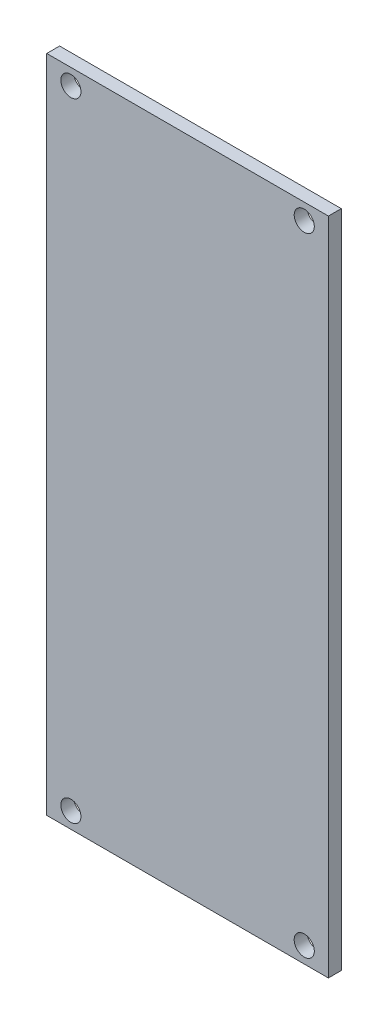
ISO-10303-21;
HEADER;
FILE_DESCRIPTION(('STEP AP214'),'2;1');
FILE_NAME('part.step','',(''),(''),'','','');
FILE_SCHEMA(('AUTOMOTIVE_DESIGN { 1 0 10303 214 1 1 1 1 }'));
ENDSEC;
DATA;
#1=APPLICATION_CONTEXT('core data for automotive mechanical design processes');
#2=APPLICATION_PROTOCOL_DEFINITION('international standard','automotive_design',2000,#1);
#3=PRODUCT_CONTEXT('',#1,'mechanical');
#4=PRODUCT('Part','Part','',(#3));
#5=PRODUCT_RELATED_PRODUCT_CATEGORY('part','',(#4));
#6=PRODUCT_DEFINITION_FORMATION('','',#4);
#7=PRODUCT_DEFINITION_CONTEXT('part definition',#1,'design');
#8=PRODUCT_DEFINITION('design','',#6,#7);
#9=PRODUCT_DEFINITION_SHAPE('','',#8);
#10=(LENGTH_UNIT() NAMED_UNIT(*) SI_UNIT(.MILLI.,.METRE.));
#11=(NAMED_UNIT(*) PLANE_ANGLE_UNIT() SI_UNIT($,.RADIAN.));
#12=(NAMED_UNIT(*) SI_UNIT($,.STERADIAN.) SOLID_ANGLE_UNIT());
#13=UNCERTAINTY_MEASURE_WITH_UNIT(LENGTH_MEASURE(1.E-05),#10,'distance_accuracy_value','');
#14=(GEOMETRIC_REPRESENTATION_CONTEXT(3) GLOBAL_UNCERTAINTY_ASSIGNED_CONTEXT((#13)) GLOBAL_UNIT_ASSIGNED_CONTEXT((#10,
#11,#12)) REPRESENTATION_CONTEXT('',''));
#15=CARTESIAN_POINT('',(0.,0.,0.));
#16=DIRECTION('',(0.,0.,1.));
#17=DIRECTION('',(1.,0.,0.));
#18=AXIS2_PLACEMENT_3D('',#15,#16,#17);
#19=CARTESIAN_POINT('',(0.,0.,-2.032));
#20=DIRECTION('',(-0.999999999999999,0.,0.));
#21=DIRECTION('',(0.,0.,1.));
#22=AXIS2_PLACEMENT_3D('',#19,#20,#21);
#23=PLANE('',#22);
#24=DIRECTION('',(0.,-1.,0.));
#25=VECTOR('',#24,1.);
#26=CARTESIAN_POINT('',(0.,0.,0.));
#27=LINE('',#26,#25);
#28=CARTESIAN_POINT('',(0.,104.14,0.));
#29=VERTEX_POINT('',#28);
#30=CARTESIAN_POINT('',(0.,0.,0.));
#31=VERTEX_POINT('',#30);
#32=EDGE_CURVE('E73',#29,#31,#27,.T.);
#33=ORIENTED_EDGE('',*,*,#32,.F.);
#34=DIRECTION('',(0.,0.,1.));
#35=VECTOR('',#34,1.);
#36=CARTESIAN_POINT('',(0.,104.14,-2.03200000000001));
#37=LINE('',#36,#35);
#38=CARTESIAN_POINT('',(0.,104.14,-2.03200000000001));
#39=VERTEX_POINT('',#38);
#40=EDGE_CURVE('E11',#39,#29,#37,.T.);
#41=ORIENTED_EDGE('',*,*,#40,.F.);
#42=DIRECTION('',(0.,-1.,0.));
#43=VECTOR('',#42,1.);
#44=CARTESIAN_POINT('',(0.,0.,-2.032));
#45=LINE('',#44,#43);
#46=CARTESIAN_POINT('',(0.,0.,-2.032));
#47=VERTEX_POINT('',#46);
#48=EDGE_CURVE('E75',#39,#47,#45,.T.);
#49=ORIENTED_EDGE('',*,*,#48,.T.);
#50=DIRECTION('',(0.,0.,1.));
#51=VECTOR('',#50,1.);
#52=CARTESIAN_POINT('',(0.,0.,-2.032));
#53=LINE('',#52,#51);
#54=EDGE_CURVE('E36',#47,#31,#53,.T.);
#55=ORIENTED_EDGE('',*,*,#54,.T.);
#56=EDGE_LOOP('',(#33,#41,#49,#55));
#57=FACE_BOUND('',#56,.T.);
#58=ADVANCED_FACE('F33',(#57),#23,.T.);
#59=CARTESIAN_POINT('',(0.,104.14,-2.03200000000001));
#60=DIRECTION('',(0.,1.,0.));
#61=DIRECTION('',(0.,0.,1.));
#62=AXIS2_PLACEMENT_3D('',#59,#60,#61);
#63=PLANE('',#62);
#64=DIRECTION('',(-0.999999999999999,0.,0.));
#65=VECTOR('',#64,1.);
#66=CARTESIAN_POINT('',(0.,104.14,0.));
#67=LINE('',#66,#65);
#68=CARTESIAN_POINT('',(44.45,104.14,0.));
#69=VERTEX_POINT('',#68);
#70=EDGE_CURVE('E90',#69,#29,#67,.T.);
#71=ORIENTED_EDGE('',*,*,#70,.F.);
#72=DIRECTION('',(0.,0.,1.));
#73=VECTOR('',#72,1.);
#74=CARTESIAN_POINT('',(44.45,104.14,-2.03200000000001));
#75=LINE('',#74,#73);
#76=CARTESIAN_POINT('',(44.45,104.14,-2.03200000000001));
#77=VERTEX_POINT('',#76);
#78=EDGE_CURVE('E41',#77,#69,#75,.T.);
#79=ORIENTED_EDGE('',*,*,#78,.F.);
#80=DIRECTION('',(-0.999999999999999,0.,0.));
#81=VECTOR('',#80,1.);
#82=CARTESIAN_POINT('',(0.,104.14,-2.03200000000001));
#83=LINE('',#82,#81);
#84=EDGE_CURVE('E80',#77,#39,#83,.T.);
#85=ORIENTED_EDGE('',*,*,#84,.T.);
#86=ORIENTED_EDGE('',*,*,#40,.T.);
#87=EDGE_LOOP('',(#71,#79,#85,#86));
#88=FACE_BOUND('',#87,.T.);
#89=ADVANCED_FACE('F110',(#88),#63,.T.);
#90=CARTESIAN_POINT('',(44.45,0.,-2.032));
#91=DIRECTION('',(0.999999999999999,0.,0.));
#92=DIRECTION('',(0.,0.,-1.));
#93=AXIS2_PLACEMENT_3D('',#90,#91,#92);
#94=PLANE('',#93);
#95=DIRECTION('',(0.,1.,0.));
#96=VECTOR('',#95,1.);
#97=CARTESIAN_POINT('',(44.45,0.,0.));
#98=LINE('',#97,#96);
#99=CARTESIAN_POINT('',(44.45,0.,0.));
#100=VERTEX_POINT('',#99);
#101=EDGE_CURVE('E87',#100,#69,#98,.T.);
#102=ORIENTED_EDGE('',*,*,#101,.F.);
#103=DIRECTION('',(0.,0.,1.));
#104=VECTOR('',#103,1.);
#105=CARTESIAN_POINT('',(44.45,0.,-2.032));
#106=LINE('',#105,#104);
#107=CARTESIAN_POINT('',(44.45,0.,-2.032));
#108=VERTEX_POINT('',#107);
#109=EDGE_CURVE('E79',#108,#100,#106,.T.);
#110=ORIENTED_EDGE('',*,*,#109,.F.);
#111=DIRECTION('',(0.,1.,0.));
#112=VECTOR('',#111,1.);
#113=CARTESIAN_POINT('',(44.45,0.,-2.032));
#114=LINE('',#113,#112);
#115=EDGE_CURVE('E103',#108,#77,#114,.T.);
#116=ORIENTED_EDGE('',*,*,#115,.T.);
#117=ORIENTED_EDGE('',*,*,#78,.T.);
#118=EDGE_LOOP('',(#102,#110,#116,#117));
#119=FACE_BOUND('',#118,.T.);
#120=ADVANCED_FACE('F107',(#119),#94,.T.);
#121=CARTESIAN_POINT('',(0.,0.,-2.032));
#122=DIRECTION('',(0.,-1.,0.));
#123=DIRECTION('',(0.,0.,-1.));
#124=AXIS2_PLACEMENT_3D('',#121,#122,#123);
#125=PLANE('',#124);
#126=DIRECTION('',(0.999999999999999,0.,0.));
#127=VECTOR('',#126,1.);
#128=CARTESIAN_POINT('',(0.,0.,0.));
#129=LINE('',#128,#127);
#130=EDGE_CURVE('E82',#31,#100,#129,.T.);
#131=ORIENTED_EDGE('',*,*,#130,.F.);
#132=ORIENTED_EDGE('',*,*,#54,.F.);
#133=DIRECTION('',(0.999999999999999,0.,0.));
#134=VECTOR('',#133,1.);
#135=CARTESIAN_POINT('',(0.,0.,-2.032));
#136=LINE('',#135,#134);
#137=EDGE_CURVE('E101',#47,#108,#136,.T.);
#138=ORIENTED_EDGE('',*,*,#137,.T.);
#139=ORIENTED_EDGE('',*,*,#109,.T.);
#140=EDGE_LOOP('',(#131,#132,#138,#139));
#141=FACE_BOUND('',#140,.T.);
#142=ADVANCED_FACE('F83',(#141),#125,.T.);
#143=CARTESIAN_POINT('',(0.,104.14,-2.03200000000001));
#144=DIRECTION('',(0.,0.,-1.));
#145=DIRECTION('',(-0.999999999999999,0.,0.));
#146=AXIS2_PLACEMENT_3D('',#143,#144,#145);
#147=PLANE('',#146);
#148=CARTESIAN_POINT('',(40.64,2.54000000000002,-2.03199999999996));
#149=DIRECTION('',(0.,0.,1.));
#150=DIRECTION('',(0.999999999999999,0.,0.));
#151=AXIS2_PLACEMENT_3D('',#148,#149,#150);
#152=CIRCLE('',#151,1.5875);
#153=CARTESIAN_POINT('',(42.2275,2.54000000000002,-2.03199999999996));
#154=VERTEX_POINT('',#153);
#155=EDGE_CURVE('E195',#154,#154,#152,.T.);
#156=ORIENTED_EDGE('',*,*,#155,.T.);
#157=EDGE_LOOP('',(#156));
#158=FACE_BOUND('',#157,.T.);
#159=CARTESIAN_POINT('',(3.81000000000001,2.54000000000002,-2.03199999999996));
#160=DIRECTION('',(0.,0.,1.));
#161=DIRECTION('',(0.999999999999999,0.,0.));
#162=AXIS2_PLACEMENT_3D('',#159,#160,#161);
#163=CIRCLE('',#162,1.5875);
#164=CARTESIAN_POINT('',(5.39750000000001,2.54000000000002,-2.03199999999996));
#165=VERTEX_POINT('',#164);
#166=EDGE_CURVE('E205',#165,#165,#163,.T.);
#167=ORIENTED_EDGE('',*,*,#166,.T.);
#168=EDGE_LOOP('',(#167));
#169=FACE_BOUND('',#168,.T.);
#170=CARTESIAN_POINT('',(40.64,101.6,-2.03200000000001));
#171=DIRECTION('',(0.,0.,1.));
#172=DIRECTION('',(0.999999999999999,0.,0.));
#173=AXIS2_PLACEMENT_3D('',#170,#171,#172);
#174=CIRCLE('',#173,1.5875);
#175=CARTESIAN_POINT('',(42.2274999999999,101.6,-2.03200000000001));
#176=VERTEX_POINT('',#175);
#177=EDGE_CURVE('E211',#176,#176,#174,.T.);
#178=ORIENTED_EDGE('',*,*,#177,.T.);
#179=EDGE_LOOP('',(#178));
#180=FACE_BOUND('',#179,.T.);
#181=CARTESIAN_POINT('',(3.80999999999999,101.6,-2.03200000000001));
#182=DIRECTION('',(0.,0.,1.));
#183=DIRECTION('',(0.999999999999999,0.,0.));
#184=AXIS2_PLACEMENT_3D('',#181,#182,#183);
#185=CIRCLE('',#184,1.5875);
#186=CARTESIAN_POINT('',(5.39749999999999,101.6,-2.03200000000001));
#187=VERTEX_POINT('',#186);
#188=EDGE_CURVE('E91',#187,#187,#185,.T.);
#189=ORIENTED_EDGE('',*,*,#188,.T.);
#190=EDGE_LOOP('',(#189));
#191=FACE_BOUND('',#190,.T.);
#192=ORIENTED_EDGE('',*,*,#48,.F.);
#193=ORIENTED_EDGE('',*,*,#84,.F.);
#194=ORIENTED_EDGE('',*,*,#115,.F.);
#195=ORIENTED_EDGE('',*,*,#137,.F.);
#196=EDGE_LOOP('',(#192,#193,#194,#195));
#197=FACE_BOUND('',#196,.T.);
#198=ADVANCED_FACE('F112',(#158,#169,#180,#191,#197),#147,.T.);
#199=CARTESIAN_POINT('',(0.,104.14,0.));
#200=DIRECTION('',(0.,0.,-1.));
#201=DIRECTION('',(-0.999999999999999,0.,0.));
#202=AXIS2_PLACEMENT_3D('',#199,#200,#201);
#203=PLANE('',#202);
#204=CARTESIAN_POINT('',(40.64,2.54,0.));
#205=DIRECTION('',(0.,0.,1.));
#206=DIRECTION('',(0.999999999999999,0.,0.));
#207=AXIS2_PLACEMENT_3D('',#204,#205,#206);
#208=CIRCLE('',#207,1.5875);
#209=CARTESIAN_POINT('',(42.2275,2.54,0.));
#210=VERTEX_POINT('',#209);
#211=EDGE_CURVE('E198',#210,#210,#208,.T.);
#212=ORIENTED_EDGE('',*,*,#211,.F.);
#213=EDGE_LOOP('',(#212));
#214=FACE_BOUND('',#213,.T.);
#215=CARTESIAN_POINT('',(3.81000000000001,2.54,0.));
#216=DIRECTION('',(0.,0.,1.));
#217=DIRECTION('',(0.999999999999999,0.,0.));
#218=AXIS2_PLACEMENT_3D('',#215,#216,#217);
#219=CIRCLE('',#218,1.5875);
#220=CARTESIAN_POINT('',(5.39750000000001,2.54,0.));
#221=VERTEX_POINT('',#220);
#222=EDGE_CURVE('E200',#221,#221,#219,.T.);
#223=ORIENTED_EDGE('',*,*,#222,.F.);
#224=EDGE_LOOP('',(#223));
#225=FACE_BOUND('',#224,.T.);
#226=CARTESIAN_POINT('',(40.64,101.6,0.));
#227=DIRECTION('',(0.,0.,1.));
#228=DIRECTION('',(0.999999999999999,0.,0.));
#229=AXIS2_PLACEMENT_3D('',#226,#227,#228);
#230=CIRCLE('',#229,1.5875);
#231=CARTESIAN_POINT('',(42.2274999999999,101.6,0.));
#232=VERTEX_POINT('',#231);
#233=EDGE_CURVE('E208',#232,#232,#230,.T.);
#234=ORIENTED_EDGE('',*,*,#233,.F.);
#235=EDGE_LOOP('',(#234));
#236=FACE_BOUND('',#235,.T.);
#237=CARTESIAN_POINT('',(3.80999999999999,101.6,0.));
#238=DIRECTION('',(0.,0.,1.));
#239=DIRECTION('',(0.999999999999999,0.,0.));
#240=AXIS2_PLACEMENT_3D('',#237,#238,#239);
#241=CIRCLE('',#240,1.5875);
#242=CARTESIAN_POINT('',(5.39749999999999,101.6,0.));
#243=VERTEX_POINT('',#242);
#244=EDGE_CURVE('E94',#243,#243,#241,.T.);
#245=ORIENTED_EDGE('',*,*,#244,.F.);
#246=EDGE_LOOP('',(#245));
#247=FACE_BOUND('',#246,.T.);
#248=ORIENTED_EDGE('',*,*,#32,.T.);
#249=ORIENTED_EDGE('',*,*,#130,.T.);
#250=ORIENTED_EDGE('',*,*,#101,.T.);
#251=ORIENTED_EDGE('',*,*,#70,.T.);
#252=EDGE_LOOP('',(#248,#249,#250,#251));
#253=FACE_BOUND('',#252,.T.);
#254=ADVANCED_FACE('F89',(#214,#225,#236,#247,#253),#203,.F.);
#255=CARTESIAN_POINT('',(3.80999999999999,101.6,-2.03200000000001));
#256=DIRECTION('',(0.,0.,1.));
#257=DIRECTION('',(0.999999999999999,0.,0.));
#258=AXIS2_PLACEMENT_3D('',#255,#256,#257);
#259=CYLINDRICAL_SURFACE('',#258,1.5875);
#260=ORIENTED_EDGE('',*,*,#188,.F.);
#261=EDGE_LOOP('',(#260));
#262=FACE_BOUND('',#261,.T.);
#263=ORIENTED_EDGE('',*,*,#244,.T.);
#264=EDGE_LOOP('',(#263));
#265=FACE_BOUND('',#264,.T.);
#266=ADVANCED_FACE('F120',(#262,#265),#259,.F.);
#267=CARTESIAN_POINT('',(40.64,101.6,-2.03200000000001));
#268=DIRECTION('',(0.,0.,1.));
#269=DIRECTION('',(0.999999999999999,0.,0.));
#270=AXIS2_PLACEMENT_3D('',#267,#268,#269);
#271=CYLINDRICAL_SURFACE('',#270,1.5875);
#272=ORIENTED_EDGE('',*,*,#177,.F.);
#273=EDGE_LOOP('',(#272));
#274=FACE_BOUND('',#273,.T.);
#275=ORIENTED_EDGE('',*,*,#233,.T.);
#276=EDGE_LOOP('',(#275));
#277=FACE_BOUND('',#276,.T.);
#278=ADVANCED_FACE('F159',(#274,#277),#271,.F.);
#279=CARTESIAN_POINT('',(3.81000000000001,2.54000000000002,-2.03199999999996));
#280=DIRECTION('',(0.,0.,1.));
#281=DIRECTION('',(0.999999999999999,0.,0.));
#282=AXIS2_PLACEMENT_3D('',#279,#280,#281);
#283=CYLINDRICAL_SURFACE('',#282,1.5875);
#284=ORIENTED_EDGE('',*,*,#166,.F.);
#285=EDGE_LOOP('',(#284));
#286=FACE_BOUND('',#285,.T.);
#287=ORIENTED_EDGE('',*,*,#222,.T.);
#288=EDGE_LOOP('',(#287));
#289=FACE_BOUND('',#288,.T.);
#290=ADVANCED_FACE('F169',(#286,#289),#283,.F.);
#291=CARTESIAN_POINT('',(40.64,2.54000000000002,-2.03199999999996));
#292=DIRECTION('',(0.,0.,1.));
#293=DIRECTION('',(0.999999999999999,0.,0.));
#294=AXIS2_PLACEMENT_3D('',#291,#292,#293);
#295=CYLINDRICAL_SURFACE('',#294,1.5875);
#296=ORIENTED_EDGE('',*,*,#155,.F.);
#297=EDGE_LOOP('',(#296));
#298=FACE_BOUND('',#297,.T.);
#299=ORIENTED_EDGE('',*,*,#211,.T.);
#300=EDGE_LOOP('',(#299));
#301=FACE_BOUND('',#300,.T.);
#302=ADVANCED_FACE('F179',(#298,#301),#295,.F.);
#303=CLOSED_SHELL('',(#58,#89,#120,#142,#198,#254,#266,#278,#290,#302));
#304=MANIFOLD_SOLID_BREP('B2',#303);
#305=ADVANCED_BREP_SHAPE_REPRESENTATION('',(#18,#304),#14);
#306=SHAPE_DEFINITION_REPRESENTATION(#9,#305);
ENDSEC;
END-ISO-10303-21;
